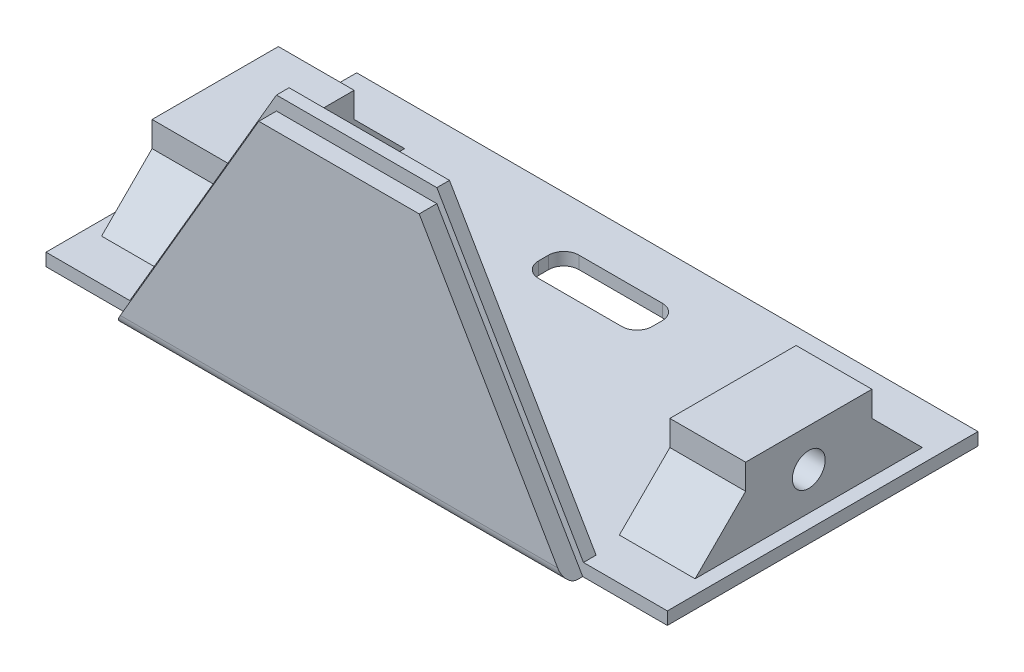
from build123d import *

# Parameters (mm, degrees)
SKIZZE1_W                       = 49.2
SKIZZE1_H                       = 24.6
AUFSATZ_LINEAR_AUSTRAGEN1_DEPTH = 1
AUFSATZ_LINEAR_AUSTRAGEN2_DEPTH = 1.4
AUFSATZ_LINEAR_AUSTRAGEN3_DEPTH = 1
AUFSATZ_LINEAR_AUSTRAGEN4_DEPTH = 0.5
SKIZZE6_W                       = 6
SKIZZE6_H                       = 10
AUFSATZ_LINEAR_AUSTRAGEN5_DEPTH = 6
SKIZZE7_R                       = 1.3
SCHNITT_LINEAR_AUSTRAGEN1_DEPTH = 6
FASE1_SIZE                      = 4
FASE1_OF_SPIEGELN2_SIZE         = 4
VERRUNDUNG1_R                   = 1
SCHNITT_LINEAR_AUSTRAGEN2_DEPTH = 1


with BuildPart() as part:
    # Skizze1 → Aufsatz-Linear austragen1 (new body)
    with BuildSketch(Plane(origin=(0, 0, 0), x_dir=(1, 0, 0), z_dir=(0, 1, 0))):
        Rectangle(SKIZZE1_W, SKIZZE1_H)
    extrude(amount=AUFSATZ_LINEAR_AUSTRAGEN1_DEPTH)

    # Skizze2 → Aufsatz-Linear austragen2 (add)
    with BuildSketch(Plane.XY.offset(12.3)):
        Polygon((17.9, 0), (-17.9, 0), (-6.35, 19.8), (6.35, 19.8), align=None)
    extrude(amount=AUFSATZ_LINEAR_AUSTRAGEN2_DEPTH)

    # Skizze4 → Aufsatz-Linear austragen3 (add)
    with BuildSketch(Plane(origin=(0, 0, 12.3), x_dir=(-1, 0, 0), z_dir=(0, 0, -1))):
        Polygon((6.35, 20.9), (17.958333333, 1), (-17.958333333, 1), (-6.35, 20.9), align=None)
    extrude(amount=AUFSATZ_LINEAR_AUSTRAGEN3_DEPTH)

    # Skizze5 → Aufsatz-Linear austragen4 (add, symmetric)
    with BuildSketch(Plane(origin=(5, 0, 0), x_dir=(0, 0, -1), z_dir=(1, 0, 0))):
        Polygon((-6.3, 1), (-11.3, 15.9), (-11.3, 1), align=None)
    aufsatz_linear_austragen4 = extrude(amount=AUFSATZ_LINEAR_AUSTRAGEN4_DEPTH, both=True)

    # Spiegeln1: Aufsatz-Linear austragen4 across plane
    add(aufsatz_linear_austragen4.mirror(Plane(origin=(0, 0, 0), x_dir=(0, 0, 1), z_dir=(1, 0, 0))))

    # Skizze6 → Aufsatz-Linear austragen5 (add)
    with BuildSketch(Plane(origin=(0, 1, 0), x_dir=(1, 0, 0), z_dir=(0, 1, 0))):
        with Locations((-20.5, 0)):
            Rectangle(SKIZZE6_W, SKIZZE6_H)
    aufsatz_linear_austragen5 = extrude(amount=AUFSATZ_LINEAR_AUSTRAGEN5_DEPTH)

    # Skizze7 → Schnitt-Linear austragen1 (cut)
    with BuildSketch(Plane.ZY.offset(23.5)):
        with Locations((0, 4)):
            Circle(SKIZZE7_R)
    schnitt_linear_austragen1 = extrude(amount=-SCHNITT_LINEAR_AUSTRAGEN1_DEPTH, mode=Mode.SUBTRACT)

    # Fase1
    fase1_edges = [part.edges().sort_by_distance(p)[0] for p in [
        (-20.5, 1, 5),
        (-20.5, 1, -5),
    ]]
    chamfer(fase1_edges, length=FASE1_SIZE)

    # Spiegeln2: Aufsatz-Linear austragen5, Schnitt-Linear austragen1 across plane
    add(aufsatz_linear_austragen5.mirror(Plane(origin=(0, 0, 0), x_dir=(0, 0, 1), z_dir=(1, 0, 0))))
    add(schnitt_linear_austragen1.mirror(Plane(origin=(0, 0, 0), x_dir=(0, 0, 1), z_dir=(1, 0, 0))), mode=Mode.SUBTRACT)

    # Fase1 of Spiegeln2
    fase1_of_spiegeln2_edges = [part.edges().sort_by_distance(p)[0] for p in [
        (20.5, 1, 5),
        (20.5, 1, -5),
    ]]
    chamfer(fase1_of_spiegeln2_edges, length=FASE1_OF_SPIEGELN2_SIZE)

    # Verrundung1
    verrundung1_edges = [part.edges().sort_by_distance(p)[0] for p in [
        (0, 0, 13.7),
    ]]
    fillet(verrundung1_edges, radius=VERRUNDUNG1_R)

    # Skizze8 → Schnitt-Linear austragen2 (cut)
    with BuildSketch(Plane.XZ):
        with BuildLine():
            Line((3.3, -5.4), (-3.3, -5.4))
            ThreePointArc((-3.3, -5.4), (-4.148528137, -5.751471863), (-4.5, -6.6))
            Line((-4.5, -6.6), (-4.5, -7.4))
            ThreePointArc((-4.5, -7.4), (-4.148528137, -8.248528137), (-3.3, -8.6))
            Line((-3.3, -8.6), (3.3, -8.6))
            ThreePointArc((3.3, -8.6), (4.148528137, -8.248528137), (4.5, -7.4))
            Line((4.5, -7.4), (4.5, -6.6))
            ThreePointArc((4.5, -6.6), (4.148528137, -5.751471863), (3.3, -5.4))
        make_face()
    extrude(amount=-SCHNITT_LINEAR_AUSTRAGEN2_DEPTH, mode=Mode.SUBTRACT)


solid = part.part
